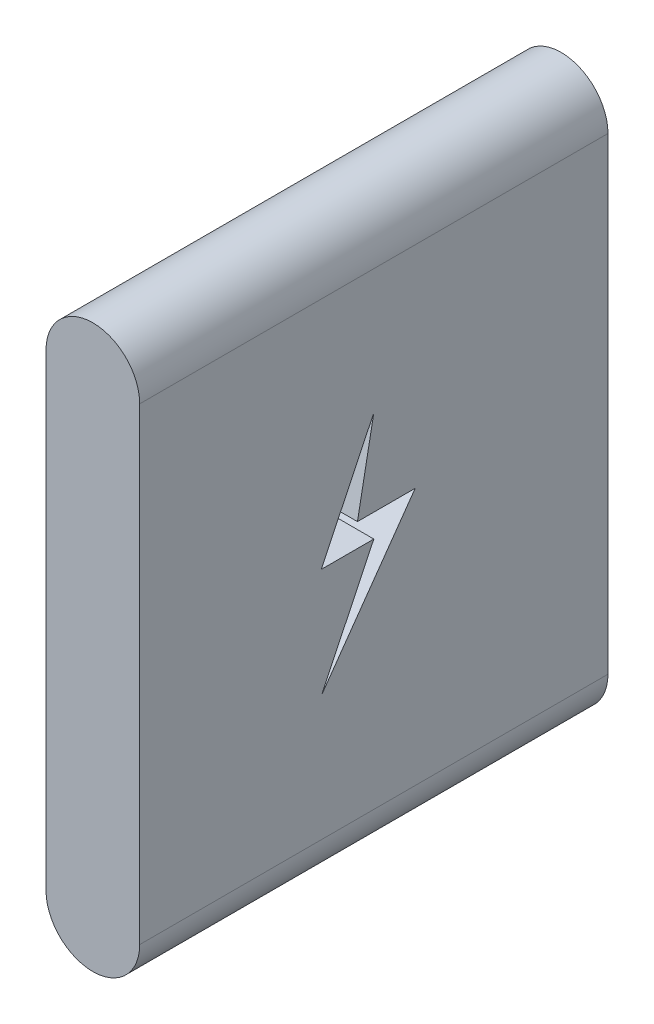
ISO-10303-21;
HEADER;
FILE_DESCRIPTION(('STEP AP214'),'2;1');
FILE_NAME('part.step','',(''),(''),'','','');
FILE_SCHEMA(('AUTOMOTIVE_DESIGN { 1 0 10303 214 1 1 1 1 }'));
ENDSEC;
DATA;
#1=APPLICATION_CONTEXT('core data for automotive mechanical design processes');
#2=APPLICATION_PROTOCOL_DEFINITION('international standard','automotive_design',2000,#1);
#3=PRODUCT_CONTEXT('',#1,'mechanical');
#4=PRODUCT('Part','Part','',(#3));
#5=PRODUCT_RELATED_PRODUCT_CATEGORY('part','',(#4));
#6=PRODUCT_DEFINITION_FORMATION('','',#4);
#7=PRODUCT_DEFINITION_CONTEXT('part definition',#1,'design');
#8=PRODUCT_DEFINITION('design','',#6,#7);
#9=PRODUCT_DEFINITION_SHAPE('','',#8);
#10=(LENGTH_UNIT() NAMED_UNIT(*) SI_UNIT(.MILLI.,.METRE.));
#11=(NAMED_UNIT(*) PLANE_ANGLE_UNIT() SI_UNIT($,.RADIAN.));
#12=(NAMED_UNIT(*) SI_UNIT($,.STERADIAN.) SOLID_ANGLE_UNIT());
#13=UNCERTAINTY_MEASURE_WITH_UNIT(LENGTH_MEASURE(1.E-05),#10,'distance_accuracy_value','');
#14=(GEOMETRIC_REPRESENTATION_CONTEXT(3) GLOBAL_UNCERTAINTY_ASSIGNED_CONTEXT((#13)) GLOBAL_UNIT_ASSIGNED_CONTEXT((#10,
#11,#12)) REPRESENTATION_CONTEXT('',''));
#15=CARTESIAN_POINT('',(0.,0.,0.));
#16=DIRECTION('',(0.,0.,1.));
#17=DIRECTION('',(1.,0.,0.));
#18=AXIS2_PLACEMENT_3D('',#15,#16,#17);
#19=CARTESIAN_POINT('',(0.,-50.,100.));
#20=DIRECTION('',(0.,0.,-1.));
#21=DIRECTION('',(-1.,0.,0.));
#22=AXIS2_PLACEMENT_3D('',#19,#20,#21);
#23=CYLINDRICAL_SURFACE('',#22,10.);
#24=CARTESIAN_POINT('',(0.,-50.,0.));
#25=DIRECTION('',(0.,0.,1.));
#26=DIRECTION('',(1.,0.,0.));
#27=AXIS2_PLACEMENT_3D('',#24,#25,#26);
#28=CIRCLE('',#27,10.);
#29=CARTESIAN_POINT('',(-10.,-50.,0.));
#30=VERTEX_POINT('',#29);
#31=CARTESIAN_POINT('',(10.,-50.,0.));
#32=VERTEX_POINT('',#31);
#33=EDGE_CURVE('E178',#30,#32,#28,.T.);
#34=ORIENTED_EDGE('',*,*,#33,.T.);
#35=DIRECTION('',(0.,0.,-1.));
#36=VECTOR('',#35,1.);
#37=CARTESIAN_POINT('',(10.,-50.,100.));
#38=LINE('',#37,#36);
#39=CARTESIAN_POINT('',(10.,-50.,100.));
#40=VERTEX_POINT('',#39);
#41=EDGE_CURVE('E11',#40,#32,#38,.T.);
#42=ORIENTED_EDGE('',*,*,#41,.F.);
#43=CARTESIAN_POINT('',(0.,-50.,100.));
#44=DIRECTION('',(0.,0.,1.));
#45=DIRECTION('',(1.,0.,0.));
#46=AXIS2_PLACEMENT_3D('',#43,#44,#45);
#47=CIRCLE('',#46,10.);
#48=CARTESIAN_POINT('',(-10.,-50.,100.));
#49=VERTEX_POINT('',#48);
#50=EDGE_CURVE('E179',#49,#40,#47,.T.);
#51=ORIENTED_EDGE('',*,*,#50,.F.);
#52=DIRECTION('',(0.,0.,-1.));
#53=VECTOR('',#52,1.);
#54=CARTESIAN_POINT('',(-10.,-50.,100.));
#55=LINE('',#54,#53);
#56=EDGE_CURVE('E189',#49,#30,#55,.T.);
#57=ORIENTED_EDGE('',*,*,#56,.T.);
#58=EDGE_LOOP('',(#34,#42,#51,#57));
#59=FACE_BOUND('',#58,.T.);
#60=ADVANCED_FACE('F39',(#59),#23,.T.);
#61=CARTESIAN_POINT('',(10.,-50.,100.));
#62=DIRECTION('',(-1.,0.,0.));
#63=DIRECTION('',(0.,0.,1.));
#64=AXIS2_PLACEMENT_3D('',#61,#62,#63);
#65=PLANE('',#64);
#66=DIRECTION('',(0.,0.901412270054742,-0.432961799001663));
#67=VECTOR('',#66,1.);
#68=CARTESIAN_POINT('',(10.,-60.1410579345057,78.8866498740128));
#69=LINE('',#68,#67);
#70=CARTESIAN_POINT('',(10.,-23.3805615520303,61.2300335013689));
#71=VERTEX_POINT('',#70);
#72=CARTESIAN_POINT('',(10.,0.,50.0000000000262));
#73=VERTEX_POINT('',#72);
#74=EDGE_CURVE('E144',#71,#73,#69,.T.);
#75=ORIENTED_EDGE('',*,*,#74,.T.);
#76=DIRECTION('',(0.,0.,1.));
#77=VECTOR('',#76,1.);
#78=CARTESIAN_POINT('',(10.,0.,100.));
#79=LINE('',#78,#77);
#80=CARTESIAN_POINT('',(10.,0.,61.2300335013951));
#81=VERTEX_POINT('',#80);
#82=EDGE_CURVE('E119',#73,#81,#79,.T.);
#83=ORIENTED_EDGE('',*,*,#82,.T.);
#84=DIRECTION('',(0.,0.901412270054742,-0.432961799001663));
#85=VECTOR('',#84,1.);
#86=CARTESIAN_POINT('',(10.,-55.7582332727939,88.0115471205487));
#87=LINE('',#86,#85);
#88=CARTESIAN_POINT('',(10.,23.3805615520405,50.0000000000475));
#89=VERTEX_POINT('',#88);
#90=EDGE_CURVE('E170',#81,#89,#87,.T.);
#91=ORIENTED_EDGE('',*,*,#90,.T.);
#92=DIRECTION('',(0.,0.982424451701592,-0.186660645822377));
#93=VECTOR('',#92,1.);
#94=CARTESIAN_POINT('',(10.,-56.6122591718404,65.1986359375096));
#95=LINE('',#94,#93);
#96=CARTESIAN_POINT('',(10.,4.9706705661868,53.4978792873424));
#97=VERTEX_POINT('',#96);
#98=EDGE_CURVE('E168',#97,#89,#95,.T.);
#99=ORIENTED_EDGE('',*,*,#98,.F.);
#100=DIRECTION('',(0.,0.,1.));
#101=VECTOR('',#100,1.);
#102=CARTESIAN_POINT('',(10.,4.9706705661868,100.));
#103=LINE('',#102,#101);
#104=CARTESIAN_POINT('',(10.,4.97067056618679,41.1632523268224));
#105=VERTEX_POINT('',#104);
#106=EDGE_CURVE('E164',#105,#97,#103,.T.);
#107=ORIENTED_EDGE('',*,*,#106,.F.);
#108=DIRECTION('',(0.,0.816232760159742,-0.577723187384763));
#109=VECTOR('',#108,1.);
#110=CARTESIAN_POINT('',(10.,-59.3976208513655,86.7226274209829));
#111=LINE('',#110,#109);
#112=EDGE_CURVE('E160',#71,#105,#111,.T.);
#113=ORIENTED_EDGE('',*,*,#112,.F.);
#114=EDGE_LOOP('',(#75,#83,#91,#99,#107,#113));
#115=FACE_BOUND('',#114,.T.);
#116=DIRECTION('',(0.,1.,0.));
#117=VECTOR('',#116,1.);
#118=CARTESIAN_POINT('',(10.,-50.,0.));
#119=LINE('',#118,#117);
#120=CARTESIAN_POINT('',(10.,50.,0.));
#121=VERTEX_POINT('',#120);
#122=EDGE_CURVE('E192',#32,#121,#119,.T.);
#123=ORIENTED_EDGE('',*,*,#122,.T.);
#124=DIRECTION('',(0.,0.,-1.));
#125=VECTOR('',#124,1.);
#126=CARTESIAN_POINT('',(10.,50.,100.));
#127=LINE('',#126,#125);
#128=CARTESIAN_POINT('',(10.,50.,100.));
#129=VERTEX_POINT('',#128);
#130=EDGE_CURVE('E46',#129,#121,#127,.T.);
#131=ORIENTED_EDGE('',*,*,#130,.F.);
#132=DIRECTION('',(0.,1.,0.));
#133=VECTOR('',#132,1.);
#134=CARTESIAN_POINT('',(10.,-50.,100.));
#135=LINE('',#134,#133);
#136=EDGE_CURVE('E182',#40,#129,#135,.T.);
#137=ORIENTED_EDGE('',*,*,#136,.F.);
#138=ORIENTED_EDGE('',*,*,#41,.T.);
#139=EDGE_LOOP('',(#123,#131,#137,#138));
#140=FACE_BOUND('',#139,.T.);
#141=ADVANCED_FACE('F220',(#115,#140),#65,.F.);
#142=CARTESIAN_POINT('',(0.,50.,100.));
#143=DIRECTION('',(0.,0.,-1.));
#144=DIRECTION('',(-1.,0.,0.));
#145=AXIS2_PLACEMENT_3D('',#142,#143,#144);
#146=CYLINDRICAL_SURFACE('',#145,10.);
#147=CARTESIAN_POINT('',(0.,50.,0.));
#148=DIRECTION('',(0.,0.,1.));
#149=DIRECTION('',(1.,0.,0.));
#150=AXIS2_PLACEMENT_3D('',#147,#148,#149);
#151=CIRCLE('',#150,10.);
#152=CARTESIAN_POINT('',(-10.,50.,0.));
#153=VERTEX_POINT('',#152);
#154=EDGE_CURVE('E194',#121,#153,#151,.T.);
#155=ORIENTED_EDGE('',*,*,#154,.T.);
#156=DIRECTION('',(0.,0.,-1.));
#157=VECTOR('',#156,1.);
#158=CARTESIAN_POINT('',(-10.,50.,100.));
#159=LINE('',#158,#157);
#160=CARTESIAN_POINT('',(-10.,50.,100.));
#161=VERTEX_POINT('',#160);
#162=EDGE_CURVE('E199',#161,#153,#159,.T.);
#163=ORIENTED_EDGE('',*,*,#162,.F.);
#164=CARTESIAN_POINT('',(0.,50.,100.));
#165=DIRECTION('',(0.,0.,1.));
#166=DIRECTION('',(1.,0.,0.));
#167=AXIS2_PLACEMENT_3D('',#164,#165,#166);
#168=CIRCLE('',#167,10.);
#169=EDGE_CURVE('E185',#129,#161,#168,.T.);
#170=ORIENTED_EDGE('',*,*,#169,.F.);
#171=ORIENTED_EDGE('',*,*,#130,.T.);
#172=EDGE_LOOP('',(#155,#163,#170,#171));
#173=FACE_BOUND('',#172,.T.);
#174=ADVANCED_FACE('F206',(#173),#146,.T.);
#175=CARTESIAN_POINT('',(-10.,-50.,100.));
#176=DIRECTION('',(1.,0.,0.));
#177=DIRECTION('',(0.,1.,0.));
#178=AXIS2_PLACEMENT_3D('',#175,#176,#177);
#179=PLANE('',#178);
#180=DIRECTION('',(0.,-0.901412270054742,0.432961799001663));
#181=VECTOR('',#180,1.);
#182=CARTESIAN_POINT('',(-10.,23.8966785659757,49.7521012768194));
#183=LINE('',#182,#181);
#184=CARTESIAN_POINT('',(-10.,23.3805615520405,50.0000000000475));
#185=VERTEX_POINT('',#184);
#186=CARTESIAN_POINT('',(-10.,0.,61.2300335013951));
#187=VERTEX_POINT('',#186);
#188=EDGE_CURVE('E121',#185,#187,#183,.T.);
#189=ORIENTED_EDGE('',*,*,#188,.T.);
#190=DIRECTION('',(0.,0.,-1.));
#191=VECTOR('',#190,1.);
#192=CARTESIAN_POINT('',(-10.,0.,0.));
#193=LINE('',#192,#191);
#194=CARTESIAN_POINT('',(-10.,0.,50.0000000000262));
#195=VERTEX_POINT('',#194);
#196=EDGE_CURVE('E116',#187,#195,#193,.T.);
#197=ORIENTED_EDGE('',*,*,#196,.T.);
#198=DIRECTION('',(0.,-0.901412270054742,0.432961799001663));
#199=VECTOR('',#198,1.);
#200=CARTESIAN_POINT('',(-10.,19.5138539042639,40.6272040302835));
#201=LINE('',#200,#199);
#202=CARTESIAN_POINT('',(-10.,-23.3805615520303,61.2300335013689));
#203=VERTEX_POINT('',#202);
#204=EDGE_CURVE('E124',#195,#203,#201,.T.);
#205=ORIENTED_EDGE('',*,*,#204,.T.);
#206=DIRECTION('',(0.,-0.816232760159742,0.577723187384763));
#207=VECTOR('',#206,1.);
#208=CARTESIAN_POINT('',(-10.,21.0698342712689,29.7683897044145));
#209=LINE('',#208,#207);
#210=CARTESIAN_POINT('',(-10.,4.97067056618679,41.1632523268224));
#211=VERTEX_POINT('',#210);
#212=EDGE_CURVE('E128',#211,#203,#209,.T.);
#213=ORIENTED_EDGE('',*,*,#212,.F.);
#214=DIRECTION('',(0.,0.,-1.));
#215=VECTOR('',#214,1.);
#216=CARTESIAN_POINT('',(-10.,4.97067056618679,0.));
#217=LINE('',#216,#215);
#218=CARTESIAN_POINT('',(-10.,4.9706705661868,53.4978792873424));
#219=VERTEX_POINT('',#218);
#220=EDGE_CURVE('E137',#219,#211,#217,.T.);
#221=ORIENTED_EDGE('',*,*,#220,.F.);
#222=DIRECTION('',(0.,-0.982424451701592,0.186660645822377));
#223=VECTOR('',#222,1.);
#224=CARTESIAN_POINT('',(-10.,9.98362925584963,52.5454171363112));
#225=LINE('',#224,#223);
#226=EDGE_CURVE('E139',#185,#219,#225,.T.);
#227=ORIENTED_EDGE('',*,*,#226,.F.);
#228=EDGE_LOOP('',(#189,#197,#205,#213,#221,#227));
#229=FACE_BOUND('',#228,.T.);
#230=DIRECTION('',(0.,-1.,0.));
#231=VECTOR('',#230,1.);
#232=CARTESIAN_POINT('',(-10.,-50.,0.));
#233=LINE('',#232,#231);
#234=EDGE_CURVE('E183',#153,#30,#233,.T.);
#235=ORIENTED_EDGE('',*,*,#234,.T.);
#236=ORIENTED_EDGE('',*,*,#56,.F.);
#237=DIRECTION('',(0.,-1.,0.));
#238=VECTOR('',#237,1.);
#239=CARTESIAN_POINT('',(-10.,-50.,100.));
#240=LINE('',#239,#238);
#241=EDGE_CURVE('E187',#161,#49,#240,.T.);
#242=ORIENTED_EDGE('',*,*,#241,.F.);
#243=ORIENTED_EDGE('',*,*,#162,.T.);
#244=EDGE_LOOP('',(#235,#236,#242,#243));
#245=FACE_BOUND('',#244,.T.);
#246=ADVANCED_FACE('F130',(#229,#245),#179,.F.);
#247=CARTESIAN_POINT('',(0.,-50.,100.));
#248=DIRECTION('',(0.,0.,1.));
#249=DIRECTION('',(1.,0.,0.));
#250=AXIS2_PLACEMENT_3D('',#247,#248,#249);
#251=PLANE('',#250);
#252=ORIENTED_EDGE('',*,*,#50,.T.);
#253=ORIENTED_EDGE('',*,*,#136,.T.);
#254=ORIENTED_EDGE('',*,*,#169,.T.);
#255=ORIENTED_EDGE('',*,*,#241,.T.);
#256=EDGE_LOOP('',(#252,#253,#254,#255));
#257=FACE_BOUND('',#256,.T.);
#258=ADVANCED_FACE('F219',(#257),#251,.T.);
#259=CARTESIAN_POINT('',(0.,-50.,0.));
#260=DIRECTION('',(0.,0.,1.));
#261=DIRECTION('',(1.,0.,0.));
#262=AXIS2_PLACEMENT_3D('',#259,#260,#261);
#263=PLANE('',#262);
#264=ORIENTED_EDGE('',*,*,#33,.F.);
#265=ORIENTED_EDGE('',*,*,#234,.F.);
#266=ORIENTED_EDGE('',*,*,#154,.F.);
#267=ORIENTED_EDGE('',*,*,#122,.F.);
#268=EDGE_LOOP('',(#264,#265,#266,#267));
#269=FACE_BOUND('',#268,.T.);
#270=ADVANCED_FACE('F212',(#269),#263,.F.);
#271=CARTESIAN_POINT('',(-10.,0.,0.));
#272=DIRECTION('',(0.,-1.,0.));
#273=DIRECTION('',(0.,0.,-1.));
#274=AXIS2_PLACEMENT_3D('',#271,#272,#273);
#275=PLANE('',#274);
#276=DIRECTION('',(1.,0.,0.));
#277=VECTOR('',#276,1.);
#278=CARTESIAN_POINT('',(-10.,0.,50.0000000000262));
#279=LINE('',#278,#277);
#280=EDGE_CURVE('E53',#195,#73,#279,.T.);
#281=ORIENTED_EDGE('',*,*,#280,.F.);
#282=ORIENTED_EDGE('',*,*,#196,.F.);
#283=DIRECTION('',(1.,0.,0.));
#284=VECTOR('',#283,1.);
#285=CARTESIAN_POINT('',(-10.,0.,61.2300335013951));
#286=LINE('',#285,#284);
#287=EDGE_CURVE('E142',#187,#81,#286,.T.);
#288=ORIENTED_EDGE('',*,*,#287,.T.);
#289=ORIENTED_EDGE('',*,*,#82,.F.);
#290=EDGE_LOOP('',(#281,#282,#288,#289));
#291=FACE_BOUND('',#290,.T.);
#292=ADVANCED_FACE('F113',(#291),#275,.F.);
#293=CARTESIAN_POINT('',(-10.,23.8966785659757,49.7521012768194));
#294=DIRECTION('',(0.,0.432961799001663,0.901412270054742));
#295=DIRECTION('',(0.,-0.901412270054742,0.432961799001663));
#296=AXIS2_PLACEMENT_3D('',#293,#294,#295);
#297=PLANE('',#296);
#298=ORIENTED_EDGE('',*,*,#287,.F.);
#299=ORIENTED_EDGE('',*,*,#188,.F.);
#300=DIRECTION('',(1.,0.,0.));
#301=VECTOR('',#300,1.);
#302=CARTESIAN_POINT('',(-10.,23.3805615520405,50.0000000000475));
#303=LINE('',#302,#301);
#304=EDGE_CURVE('E145',#185,#89,#303,.T.);
#305=ORIENTED_EDGE('',*,*,#304,.T.);
#306=ORIENTED_EDGE('',*,*,#90,.F.);
#307=EDGE_LOOP('',(#298,#299,#305,#306));
#308=FACE_BOUND('',#307,.T.);
#309=ADVANCED_FACE('F237',(#308),#297,.F.);
#310=CARTESIAN_POINT('',(-10.,9.98362925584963,52.5454171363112));
#311=DIRECTION('',(0.,0.186660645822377,0.982424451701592));
#312=DIRECTION('',(0.,-0.982424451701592,0.186660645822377));
#313=AXIS2_PLACEMENT_3D('',#310,#311,#312);
#314=PLANE('',#313);
#315=ORIENTED_EDGE('',*,*,#98,.T.);
#316=ORIENTED_EDGE('',*,*,#304,.F.);
#317=ORIENTED_EDGE('',*,*,#226,.T.);
#318=DIRECTION('',(1.,0.,0.));
#319=VECTOR('',#318,1.);
#320=CARTESIAN_POINT('',(-10.,4.9706705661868,53.4978792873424));
#321=LINE('',#320,#319);
#322=EDGE_CURVE('E146',#219,#97,#321,.T.);
#323=ORIENTED_EDGE('',*,*,#322,.T.);
#324=EDGE_LOOP('',(#315,#316,#317,#323));
#325=FACE_BOUND('',#324,.T.);
#326=ADVANCED_FACE('F247',(#325),#314,.T.);
#327=CARTESIAN_POINT('',(-10.,4.97067056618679,0.));
#328=DIRECTION('',(0.,-1.,0.));
#329=DIRECTION('',(0.,0.,-1.));
#330=AXIS2_PLACEMENT_3D('',#327,#328,#329);
#331=PLANE('',#330);
#332=ORIENTED_EDGE('',*,*,#106,.T.);
#333=ORIENTED_EDGE('',*,*,#322,.F.);
#334=ORIENTED_EDGE('',*,*,#220,.T.);
#335=DIRECTION('',(1.,0.,0.));
#336=VECTOR('',#335,1.);
#337=CARTESIAN_POINT('',(-10.,4.97067056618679,41.1632523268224));
#338=LINE('',#337,#336);
#339=EDGE_CURVE('E149',#211,#105,#338,.T.);
#340=ORIENTED_EDGE('',*,*,#339,.T.);
#341=EDGE_LOOP('',(#332,#333,#334,#340));
#342=FACE_BOUND('',#341,.T.);
#343=ADVANCED_FACE('F243',(#342),#331,.T.);
#344=CARTESIAN_POINT('',(-10.,21.0698342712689,29.7683897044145));
#345=DIRECTION('',(0.,0.577723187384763,0.816232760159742));
#346=DIRECTION('',(0.,-0.816232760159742,0.577723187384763));
#347=AXIS2_PLACEMENT_3D('',#344,#345,#346);
#348=PLANE('',#347);
#349=ORIENTED_EDGE('',*,*,#112,.T.);
#350=ORIENTED_EDGE('',*,*,#339,.F.);
#351=ORIENTED_EDGE('',*,*,#212,.T.);
#352=DIRECTION('',(1.,0.,0.));
#353=VECTOR('',#352,1.);
#354=CARTESIAN_POINT('',(-10.,-23.3805615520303,61.2300335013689));
#355=LINE('',#354,#353);
#356=EDGE_CURVE('E58',#203,#71,#355,.T.);
#357=ORIENTED_EDGE('',*,*,#356,.T.);
#358=EDGE_LOOP('',(#349,#350,#351,#357));
#359=FACE_BOUND('',#358,.T.);
#360=ADVANCED_FACE('F240',(#359),#348,.T.);
#361=CARTESIAN_POINT('',(-10.,19.5138539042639,40.6272040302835));
#362=DIRECTION('',(0.,0.432961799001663,0.901412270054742));
#363=DIRECTION('',(0.,-0.901412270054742,0.432961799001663));
#364=AXIS2_PLACEMENT_3D('',#361,#362,#363);
#365=PLANE('',#364);
#366=ORIENTED_EDGE('',*,*,#356,.F.);
#367=ORIENTED_EDGE('',*,*,#204,.F.);
#368=ORIENTED_EDGE('',*,*,#280,.T.);
#369=ORIENTED_EDGE('',*,*,#74,.F.);
#370=EDGE_LOOP('',(#366,#367,#368,#369));
#371=FACE_BOUND('',#370,.T.);
#372=ADVANCED_FACE('F125',(#371),#365,.F.);
#373=CLOSED_SHELL('',(#60,#141,#174,#246,#258,#270,#292,#309,#326,#343,#360,#372));
#374=MANIFOLD_SOLID_BREP('B2',#373);
#375=ADVANCED_BREP_SHAPE_REPRESENTATION('',(#18,#374),#14);
#376=SHAPE_DEFINITION_REPRESENTATION(#9,#375);
ENDSEC;
END-ISO-10303-21;
